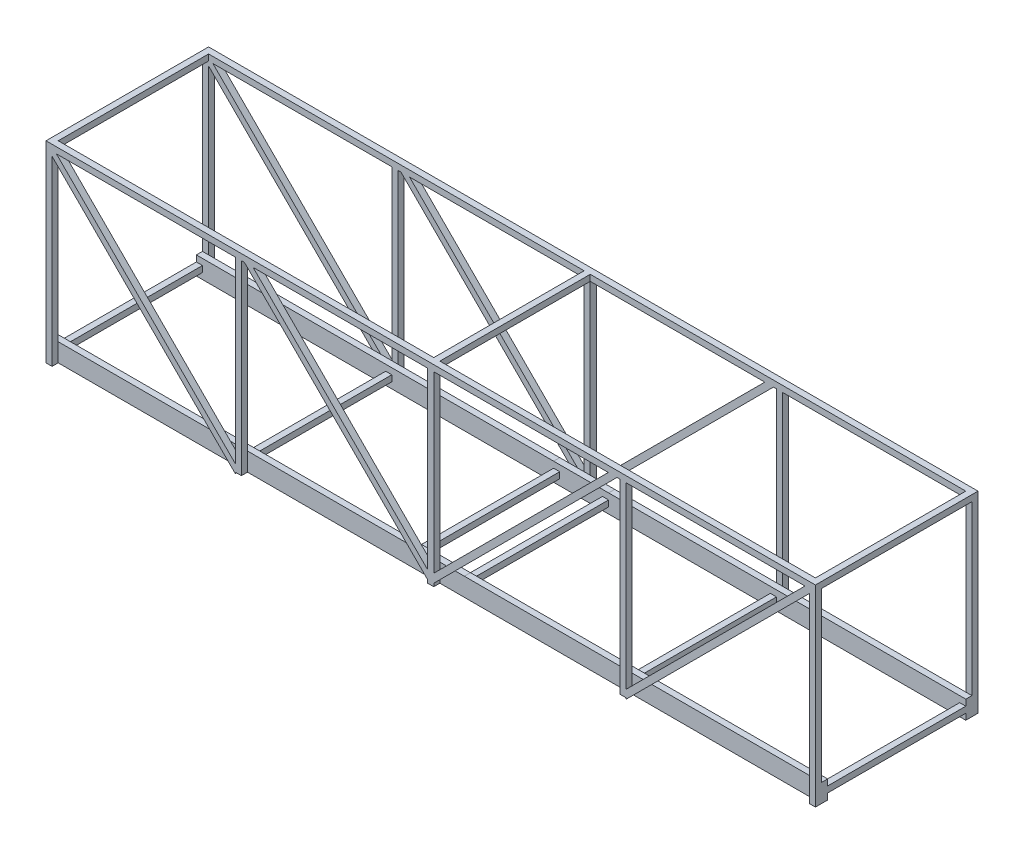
from build123d import *

# Parameters (mm, degrees)
SKETCH12_W                       = 3.175
SKETCH12_H                       = 9.525
STRUCTURAL_MEMBER1_DEPTH         = 400
SKETCH12_ON_SEGMENT_2_W          = 3.175
SKETCH12_ON_SEGMENT_2_H          = 9.525
STRUCTURAL_MEMBER1_2_DEPTH       = 400
SKETCH14_W                       = 3.175
SKETCH14_H                       = 3.175
STRUCTURAL_MEMBER2_DEPTH         = 75
SKETCH15_W                       = 3.175
SKETCH15_H                       = 3.175
STRUCTURAL_MEMBER3_DEPTH         = 75
SKETCH16_W                       = 3.175
SKETCH16_H                       = 3.175
STRUCTURAL_MEMBER4_DEPTH         = 75
SKETCH16_ON_SEGMENT_2_W          = 3.175
SKETCH16_ON_SEGMENT_2_H          = 3.175
STRUCTURAL_MEMBER4_2_DEPTH       = 75
SKETCH16_ON_SEGMENT_3_W          = 3.175
SKETCH16_ON_SEGMENT_3_H          = 3.175
STRUCTURAL_MEMBER4_3_DEPTH       = 75
SKETCH16_ON_SEGMENT_4_W          = 3.175
SKETCH16_ON_SEGMENT_4_H          = 3.175
STRUCTURAL_MEMBER4_4_DEPTH       = 75
SKETCH17_W                       = 3.175
SKETCH17_H                       = 3.175
STRUCTURAL_MEMBER5_DEPTH         = 100
SKETCH19_W                       = 3.175
SKETCH19_H                       = 3.175
STRUCTURAL_MEMBER6_DEPTH         = 100
SKETCH110_W                      = 3.175
SKETCH110_H                      = 3.175
STRUCTURAL_MEMBER7_DEPTH         = 100
SKETCH110_ON_SEGMENT_2_W         = 3.175
SKETCH110_ON_SEGMENT_2_H         = 3.175
STRUCTURAL_MEMBER7_2_DEPTH       = 100
SKETCH110_ON_SEGMENT_3_W         = 3.175
SKETCH110_ON_SEGMENT_3_H         = 3.175
STRUCTURAL_MEMBER7_3_DEPTH       = 100
SKETCH111_W                      = 3.175
SKETCH111_H                      = 3.175
STRUCTURAL_MEMBER8_DEPTH         = 400
SKETCH125_W                      = 3.175
SKETCH125_H                      = 3.175
STRUCTURAL_MEMBER15_DEPTH        = 100
SKETCH126_W                      = 3.175
SKETCH126_H                      = 3.175
STRUCTURAL_MEMBER16_DEPTH        = 100
SKETCH127_W                      = 3.175
SKETCH127_H                      = 3.175
STRUCTURAL_MEMBER17_DEPTH        = 100
SKETCH127_ON_SEGMENT_2_W         = 3.175
SKETCH127_ON_SEGMENT_2_H         = 3.175
STRUCTURAL_MEMBER17_2_DEPTH      = 100
SKETCH127_ON_SEGMENT_3_W         = 3.175
SKETCH127_ON_SEGMENT_3_H         = 3.175
STRUCTURAL_MEMBER17_3_DEPTH      = 100
SKETCH128_W                      = 3.175
SKETCH128_H                      = 3.175
STRUCTURAL_MEMBER18_DEPTH        = 400
SKETCH113_ON_SEGMENT_1_W         = 3.175
SKETCH113_ON_SEGMENT_1_H         = 3.175
STRUCTURAL_MEMBER9_DEPTH         = 142.421356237
SKETCH113_W                      = 3.175
SKETCH113_H                      = 3.175
STRUCTURAL_MEMBER9_2_DEPTH       = 141.421356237
BODY_START                       = 138.246356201
BODY_21_RUN_ON_DEPTH             = 76.130742
SKETCH130_ON_SEGMENT_1_W         = 3.175
SKETCH130_ON_SEGMENT_1_H         = 3.175
STRUCTURAL_MEMBER19_DEPTH        = 146.911484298
STRUCTURAL_MEMBER19_2_DEPTH      = 141.421356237
STRUCTURAL_MEMBER19_2_DEPTH_BACK = 5.490128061
SKETCH130_W                      = 3.175
SKETCH130_H                      = 3.175
SKETCH116_W                      = 3.175
SKETCH116_H                      = 3.175
STRUCTURAL_MEMBER10_DEPTH        = 141.421356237
BODY_25_RUN_ON_DEPTH             = 143.66642
SKETCH117_W                      = 3.175
SKETCH117_H                      = 3.175
STRUCTURAL_MEMBER11_DEPTH        = 141.421356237
SKETCH133_W                      = 3.175
SKETCH133_H                      = 3.175
STRUCTURAL_MEMBER21_DEPTH        = 141.421356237
BODY_27_RUN_ON_DEPTH             = 143.66642
SKETCH134_W                      = 3.175
SKETCH134_H                      = 3.175
STRUCTURAL_MEMBER22_DEPTH        = 141.421356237
SKETCH119_W                      = 3.175
SKETCH119_H                      = 3.175
STRUCTURAL_MEMBER12_DEPTH        = 78.175
SKETCH120_W                      = 3.175
SKETCH120_H                      = 3.175
STRUCTURAL_MEMBER13_DEPTH        = 78.175
SKETCH123_W                      = 3.175
SKETCH123_H                      = 3.175
STRUCTURAL_MEMBER14_DEPTH        = 78.175


with BuildPart() as part:
    # Sketch12 → Structural Member1 (new body)
    with BuildSketch(Plane(origin=(-200, 0, 37.5), x_dir=(0, 0, -1), z_dir=(1, 0, 0))):
        Rectangle(SKETCH12_W, SKETCH12_H)
    extrude(amount=STRUCTURAL_MEMBER1_DEPTH)


with BuildPart() as body_2:
    # Sketch12 on segment 2 (on carried to segment 2) → Structural Member1 2 (new body)
    with BuildSketch(Plane(origin=(-200, 0, -37.5), x_dir=(0, 0, -1), z_dir=(1, 0, 0))):
        Rectangle(SKETCH12_ON_SEGMENT_2_W, SKETCH12_ON_SEGMENT_2_H)
    extrude(amount=STRUCTURAL_MEMBER1_2_DEPTH)


with BuildPart() as body_3:
    # Sketch14 → Structural Member2 (new body)
    with BuildSketch(Plane(origin=(198.4125, 0, 37.5), x_dir=(-1, 0, 0), z_dir=(0, 0, -1))):
        Rectangle(SKETCH14_W, SKETCH14_H)
    extrude(amount=STRUCTURAL_MEMBER2_DEPTH)

    # Trim_Extend1 17: cut part
    add(part.part, mode=Mode.SUBTRACT)

    # Trim_Extend1 20
    split(bisect_by=Plane(origin=(0, 0, -35.9125), x_dir=(0, -1, 0), z_dir=(0, 0, 1)), keep=Keep.TOP)


with BuildPart() as body_4:
    # Sketch15 → Structural Member3 (new body)
    with BuildSketch(Plane(origin=(-198.4125, 0, 37.5), x_dir=(-1, 0, 0), z_dir=(0, 0, -1))):
        Rectangle(SKETCH15_W, SKETCH15_H)
    extrude(amount=STRUCTURAL_MEMBER3_DEPTH)

    # Trim_Extend1 17: cut part
    add(part.part, mode=Mode.SUBTRACT)

    # Trim_Extend1 34: cut body 2
    add(body_2.part, mode=Mode.SUBTRACT)


with BuildPart() as body_5:
    # Sketch16 → Structural Member4 (new body)
    with BuildSketch(Plane(origin=(-100, 0, -37.5), x_dir=(1, 0, 0), z_dir=(0, 0, 1))):
        Rectangle(SKETCH16_W, SKETCH16_H)
    extrude(amount=STRUCTURAL_MEMBER4_DEPTH)

    # Trim_Extend1
    split(bisect_by=Plane.YX.offset(-35.9125), keep=Keep.TOP)

    # Trim_Extend1 20
    split(bisect_by=Plane(origin=(0, 0, -35.9125), x_dir=(0, -1, 0), z_dir=(0, 0, 1)), keep=Keep.TOP)


with BuildPart() as body_6:
    # Sketch16 on segment 2 (on carried to segment 2) → Structural Member4 2 (new body)
    with BuildSketch(Plane(origin=(-12.7, 0, -37.5), x_dir=(1, 0, 0), z_dir=(0, 0, 1))):
        Rectangle(SKETCH16_ON_SEGMENT_2_W, SKETCH16_ON_SEGMENT_2_H)
    extrude(amount=STRUCTURAL_MEMBER4_2_DEPTH)

    # Trim_Extend1 17: cut part
    add(part.part, mode=Mode.SUBTRACT)

    # Trim_Extend1 34: cut body 2
    add(body_2.part, mode=Mode.SUBTRACT)


with BuildPart() as body_7:
    # Sketch16 on segment 3 (on carried to segment 3) → Structural Member4 3 (new body)
    with BuildSketch(Plane(origin=(12.7, 0, -37.5), x_dir=(1, 0, 0), z_dir=(0, 0, 1))):
        Rectangle(SKETCH16_ON_SEGMENT_3_W, SKETCH16_ON_SEGMENT_3_H)
    extrude(amount=STRUCTURAL_MEMBER4_3_DEPTH)

    # Trim_Extend1 17: cut part
    add(part.part, mode=Mode.SUBTRACT)

    # Trim_Extend1 34: cut body 2
    add(body_2.part, mode=Mode.SUBTRACT)


with BuildPart() as body_8:
    # Sketch16 on segment 4 (on carried to segment 4) → Structural Member4 4 (new body)
    with BuildSketch(Plane(origin=(100, 0, -37.5), x_dir=(1, 0, 0), z_dir=(0, 0, 1))):
        Rectangle(SKETCH16_ON_SEGMENT_4_W, SKETCH16_ON_SEGMENT_4_H)
    extrude(amount=STRUCTURAL_MEMBER4_4_DEPTH)

    # Trim_Extend1
    split(bisect_by=Plane.YX.offset(-35.9125), keep=Keep.TOP)

    # Trim_Extend1 20
    split(bisect_by=Plane(origin=(0, 0, -35.9125), x_dir=(0, -1, 0), z_dir=(0, 0, 1)), keep=Keep.TOP)


with BuildPart() as body_9:
    # Sketch17 → Structural Member5 (new body)
    with BuildSketch(Plane(origin=(-198.4125, -4.7625, 40.675), x_dir=(-1, 0, 0), z_dir=(0, 1, 0))):
        Rectangle(SKETCH17_W, SKETCH17_H)
    extrude(amount=STRUCTURAL_MEMBER5_DEPTH)


with BuildPart() as body_10:
    # Sketch19 → Structural Member6 (new body)
    with BuildSketch(Plane(origin=(198.4125, -4.7625, 40.675), x_dir=(-1, 0, 0), z_dir=(0, 1, 0))):
        Rectangle(SKETCH19_W, SKETCH19_H)
    extrude(amount=STRUCTURAL_MEMBER6_DEPTH)


with BuildPart() as body_11:
    # Sketch110 → Structural Member7 (new body)
    with BuildSketch(Plane(origin=(100, 95.2375, 40.675), x_dir=(1, 0, 0), z_dir=(0, -1, 0))):
        Rectangle(SKETCH110_W, SKETCH110_H)
    extrude(amount=STRUCTURAL_MEMBER7_DEPTH)

    # Trim_Extend2 7
    split(bisect_by=Plane(origin=(0, 92.0625, 40.675), x_dir=(1, 0, 0), z_dir=(0, -1, 0)), keep=Keep.TOP)


with BuildPart() as body_12:
    # Sketch110 on segment 2 (on carried to segment 2) → Structural Member7 2 (new body)
    with BuildSketch(Plane(origin=(0, 95.2375, 40.675), x_dir=(1, 0, 0), z_dir=(0, -1, 0))):
        Rectangle(SKETCH110_ON_SEGMENT_2_W, SKETCH110_ON_SEGMENT_2_H)
    extrude(amount=STRUCTURAL_MEMBER7_2_DEPTH)

    # Trim_Extend2 7
    split(bisect_by=Plane(origin=(0, 92.0625, 40.675), x_dir=(1, 0, 0), z_dir=(0, -1, 0)), keep=Keep.TOP)


with BuildPart() as body_13:
    # Sketch110 on segment 3 (on carried to segment 3) → Structural Member7 3 (new body)
    with BuildSketch(Plane(origin=(-100, 95.2375, 40.675), x_dir=(1, 0, 0), z_dir=(0, -1, 0))):
        Rectangle(SKETCH110_ON_SEGMENT_3_W, SKETCH110_ON_SEGMENT_3_H)
    extrude(amount=STRUCTURAL_MEMBER7_3_DEPTH)


with BuildPart() as body_14:
    # Sketch111 → Structural Member8 (new body)
    with BuildSketch(Plane(origin=(-200, 93.65, 40.675), x_dir=(0, 1, 0), z_dir=(1, 0, 0))):
        Rectangle(SKETCH111_W, SKETCH111_H)
    extrude(amount=STRUCTURAL_MEMBER8_DEPTH)


with BuildPart() as body_9_1:
    add(body_9.part)

    # Trim_Extend2 17: cut body 14
    add(body_14.part, mode=Mode.SUBTRACT)


with BuildPart() as body_13_1:
    add(body_13.part)

    # Trim_Extend2 17: cut body 14
    add(body_14.part, mode=Mode.SUBTRACT)


with BuildPart() as body_10_1:
    add(body_10.part)

    # Trim_Extend2 17: cut body 14
    add(body_14.part, mode=Mode.SUBTRACT)


with BuildPart() as body_15:
    # Sketch125 → Structural Member15 (new body)
    with BuildSketch(Plane(origin=(198.4125, -4.7625, -40.675), x_dir=(1, 0, 0), z_dir=(0, 1, 0))):
        Rectangle(SKETCH125_W, SKETCH125_H)
    extrude(amount=STRUCTURAL_MEMBER15_DEPTH)

    # Trim_Extend3 5
    split(bisect_by=Plane(origin=(0, 92.0625, -40.675), x_dir=(1, 0, 0), z_dir=(0, -1, 0)), keep=Keep.TOP)


with BuildPart() as body_16:
    # Sketch126 → Structural Member16 (new body)
    with BuildSketch(Plane(origin=(-198.4125, -4.7625, -40.675), x_dir=(1, 0, 0), z_dir=(0, 1, 0))):
        Rectangle(SKETCH126_W, SKETCH126_H)
    extrude(amount=STRUCTURAL_MEMBER16_DEPTH)


with BuildPart() as body_17:
    # Sketch127 → Structural Member17 (new body)
    with BuildSketch(Plane(origin=(100, -4.7625, -40.675), x_dir=(1, 0, 0), z_dir=(0, 1, 0))):
        Rectangle(SKETCH127_W, SKETCH127_H)
    extrude(amount=STRUCTURAL_MEMBER17_DEPTH)


with BuildPart() as body_18:
    # Sketch127 on segment 2 (on carried to segment 2) → Structural Member17 2 (new body)
    with BuildSketch(Plane(origin=(0, -4.7625, -40.675), x_dir=(1, 0, 0), z_dir=(0, 1, 0))):
        Rectangle(SKETCH127_ON_SEGMENT_2_W, SKETCH127_ON_SEGMENT_2_H)
    extrude(amount=STRUCTURAL_MEMBER17_2_DEPTH)

    # Trim_Extend3 5
    split(bisect_by=Plane(origin=(0, 92.0625, -40.675), x_dir=(1, 0, 0), z_dir=(0, -1, 0)), keep=Keep.TOP)


with BuildPart() as body_19:
    # Sketch127 on segment 3 (on carried to segment 3) → Structural Member17 3 (new body)
    with BuildSketch(Plane(origin=(-100, -4.7625, -40.675), x_dir=(1, 0, 0), z_dir=(0, 1, 0))):
        Rectangle(SKETCH127_ON_SEGMENT_3_W, SKETCH127_ON_SEGMENT_3_H)
    extrude(amount=STRUCTURAL_MEMBER17_3_DEPTH)

    # Trim_Extend3 5
    split(bisect_by=Plane(origin=(0, 92.0625, -40.675), x_dir=(1, 0, 0), z_dir=(0, -1, 0)), keep=Keep.TOP)


with BuildPart() as body_20:
    # Sketch128 → Structural Member18 (new body)
    with BuildSketch(Plane(origin=(-200, 93.65, -40.675), x_dir=(0, -1, 0), z_dir=(1, 0, 0))):
        Rectangle(SKETCH128_W, SKETCH128_H)
    extrude(amount=STRUCTURAL_MEMBER18_DEPTH)


with BuildPart() as body_17_1:
    add(body_17.part)

    # Trim_Extend3 17: cut body 20
    add(body_20.part, mode=Mode.SUBTRACT)


with BuildPart() as body_16_1:
    add(body_16.part)

    # Trim_Extend3 17: cut body 20
    add(body_20.part, mode=Mode.SUBTRACT)


with BuildPart() as body_21:
    # Sketch113 on segment 1 (on carried to segment 1) → Structural Member9 (new body)
    with BuildSketch(Plane(origin=(-98.877467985, 96.360032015, 40.675), x_dir=(0.707106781, 0.707106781, 0), z_dir=(0.707106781, -0.707106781, 0))):
        Rectangle(SKETCH113_ON_SEGMENT_1_W, SKETCH113_ON_SEGMENT_1_H)
    extrude(amount=STRUCTURAL_MEMBER9_DEPTH)

    # Structural Member9 end butt 1
    split(bisect_by=Plane(origin=(-2.24506403, -2.51743597, 39.0875), x_dir=(-0.707106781, -0.707106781, 0), z_dir=(-0.707106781, 0.707106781, 0)), keep=Keep.TOP)

    # Sketch113 on segment 1 (on carried to segment 1) → body 21 run on (add)
    with BuildSketch(Plane(origin=(-98.877467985, 96.360032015, 40.675), x_dir=(0.707106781, 0.707106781, 0), z_dir=(0.707106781, -0.707106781, 0)).offset(BODY_START)):
        Rectangle(SKETCH113_ON_SEGMENT_1_W, SKETCH113_ON_SEGMENT_1_H)
    extrude(amount=BODY_21_RUN_ON_DEPTH)

    # Trim_Extend6 7
    split(bisect_by=Plane(origin=(0, 92.0625, 40.675), x_dir=(1, 0, 0), z_dir=(0, -1, 0)), keep=Keep.TOP)

    # Trim_Extend6 24
    split(bisect_by=Plane(origin=(-1.5875, 43.65, 40.675), x_dir=(0, -1, 0), z_dir=(-1, 0, 0)), keep=Keep.TOP)


with BuildPart() as body_22:
    # Sketch113 → Structural Member9 2 (new body)
    with BuildSketch(Plane(origin=(-1.122532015, -3.639967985, 40.675), x_dir=(-0.707106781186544, 0.7071067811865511, 0), z_dir=(0.7071067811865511, 0.707106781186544, 0))):
        Rectangle(SKETCH113_W, SKETCH113_H)
    extrude(amount=STRUCTURAL_MEMBER9_2_DEPTH)

    # Trim_Extend6 7
    split(bisect_by=Plane(origin=(0, 92.0625, 40.675), x_dir=(1, 0, 0), z_dir=(0, -1, 0)), keep=Keep.TOP)

    # Trim_Extend6 22
    split(bisect_by=Plane(origin=(1.5875, 43.65, 40.675), x_dir=(0, 1, 0), z_dir=(1, 0, 0)), keep=Keep.TOP)


with BuildPart() as body_23:
    # Sketch130 on segment 1 (on carried to segment 1) → Structural Member19 (new body)
    with BuildSketch(Plane(origin=(-98.877467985, 96.360032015, -40.675), x_dir=(-0.707106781, -0.707106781, 0), z_dir=(0.707106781, -0.707106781, 0))):
        Rectangle(SKETCH130_ON_SEGMENT_1_W, SKETCH130_ON_SEGMENT_1_H)
    extrude(amount=STRUCTURAL_MEMBER19_DEPTH)

    # Structural Member19 mitre 1
    split(bisect_by=Plane(origin=(0, -4.7625, -39.0875), x_dir=(0, -1, 0), z_dir=(-1, 0, 0)), keep=Keep.TOP)

    # Trim_Extend17 5
    split(bisect_by=Plane(origin=(0, 92.0625, -40.675), x_dir=(1, 0, 0), z_dir=(0, -1, 0)), keep=Keep.TOP)

    # Trim_Extend17 24
    split(bisect_by=Plane(origin=(-1.5875, 43.65, -40.675), x_dir=(0, -1, 0), z_dir=(-1, 0, 0)), keep=Keep.TOP)


with BuildPart() as body_24:
    # Sketch130 → Structural Member19 2 (new, two sides: drawn at the far end of the back side and taken through both)
    with BuildSketch(Plane(origin=(-1.122532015, -3.639967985, -40.675), x_dir=(0.7071067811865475, -0.7071067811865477, 0), z_dir=(0.7071067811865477, 0.7071067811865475, 0)).offset(-STRUCTURAL_MEMBER19_2_DEPTH_BACK)):
        Rectangle(SKETCH130_W, SKETCH130_H)
    extrude(amount=STRUCTURAL_MEMBER19_2_DEPTH + STRUCTURAL_MEMBER19_2_DEPTH_BACK)

    # Structural Member19 2 mitre 1
    split(bisect_by=Plane(origin=(0, -4.7625, -39.0875), x_dir=(0, 1, 0), z_dir=(1, 0, 0)), keep=Keep.TOP)

    # Trim_Extend17 5
    split(bisect_by=Plane(origin=(0, 92.0625, -40.675), x_dir=(1, 0, 0), z_dir=(0, -1, 0)), keep=Keep.TOP)

    # Trim_Extend17 34: cut body 18
    add(body_18.part, mode=Mode.SUBTRACT)


with BuildPart() as body_25:
    # Sketch116 → Structural Member10 (new body)
    with BuildSketch(Plane(origin=(100, -4.7625, 40.675), x_dir=(-0.7071067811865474, 0.7071067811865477, 0), z_dir=(0.7071067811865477, 0.7071067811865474, 0))):
        Rectangle(SKETCH116_W, SKETCH116_H)
    extrude(amount=STRUCTURAL_MEMBER10_DEPTH)

    # Sketch116 → body 25 run on (add)
    with BuildSketch(Plane(origin=(100, -4.7625, 40.675), x_dir=(-0.7071067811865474, 0.7071067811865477, 0), z_dir=(0.7071067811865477, 0.7071067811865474, 0))):
        Rectangle(SKETCH116_W, SKETCH116_H)
    extrude(amount=-BODY_25_RUN_ON_DEPTH)

    # Trim_Extend8 5
    split(bisect_by=Plane(origin=(101.5875, 43.65, 40.675), x_dir=(0, 1, 0), z_dir=(1, 0, 0)), keep=Keep.TOP)

    # Trim_Extend8 24
    split(bisect_by=Plane(origin=(0, 92.0625, 40.675), x_dir=(1, 0, 0), z_dir=(0, -1, 0)), keep=Keep.TOP)

    # Trim_Extend8 39
    split(bisect_by=Plane(origin=(196.825, 43.65, 40.675), x_dir=(0, -1, 0), z_dir=(-1, 0, 0)), keep=Keep.TOP)


with BuildPart() as body_26:
    # Sketch117 → Structural Member11 (new body)
    with BuildSketch(Plane(origin=(-200, 95.2375, 40.675), x_dir=(0.7071067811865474, 0.7071067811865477, 0), z_dir=(0.7071067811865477, -0.7071067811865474, 0))):
        Rectangle(SKETCH117_W, SKETCH117_H)
    extrude(amount=STRUCTURAL_MEMBER11_DEPTH)

    # Trim_Extend16 7
    split(bisect_by=Plane(origin=(-101.5875, 43.65, 40.675), x_dir=(0, -1, 0), z_dir=(-1, 0, 0)), keep=Keep.TOP)

    # Trim_Extend15 7
    split(bisect_by=Plane(origin=(0, 92.0625, 40.675), x_dir=(1, 0, 0), z_dir=(0, -1, 0)), keep=Keep.TOP)

    # Trim_Extend15 34: cut body 9
    add(body_9_1.part, mode=Mode.SUBTRACT)


with BuildPart() as body_27:
    # Sketch133 → Structural Member21 (new body)
    with BuildSketch(Plane(origin=(-100, -4.7625, -40.675), x_dir=(0.7071067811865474, 0.7071067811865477, 0), z_dir=(-0.7071067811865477, 0.7071067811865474, 0))):
        Rectangle(SKETCH133_W, SKETCH133_H)
    extrude(amount=STRUCTURAL_MEMBER21_DEPTH)

    # Sketch133 → body 27 run on (add)
    with BuildSketch(Plane(origin=(-100, -4.7625, -40.675), x_dir=(0.7071067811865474, 0.7071067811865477, 0), z_dir=(-0.7071067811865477, 0.7071067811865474, 0))):
        Rectangle(SKETCH133_W, SKETCH133_H)
    extrude(amount=-BODY_27_RUN_ON_DEPTH)

    # Trim_Extend13 7
    split(bisect_by=Plane(origin=(-101.5875, 43.65, -40.675), x_dir=(0, -1, 0), z_dir=(-1, 0, 0)), keep=Keep.TOP)

    # Trim_Extend13 22
    split(bisect_by=Plane(origin=(0, 92.0625, -40.675), x_dir=(1, 0, 0), z_dir=(0, -1, 0)), keep=Keep.TOP)

    # Trim_Extend13 39
    split(bisect_by=Plane(origin=(-196.825, 43.65, -40.675), x_dir=(0, 1, 0), z_dir=(1, 0, 0)), keep=Keep.TOP)


with BuildPart() as body_28:
    # Sketch134 → Structural Member22 (new body)
    with BuildSketch(Plane(origin=(100, -4.7625, -40.675), x_dir=(0.7071067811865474, -0.7071067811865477, 0), z_dir=(0.7071067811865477, 0.7071067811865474, 0))):
        Rectangle(SKETCH134_W, SKETCH134_H)
    extrude(amount=STRUCTURAL_MEMBER22_DEPTH)

    # Trim_Extend14 7
    split(bisect_by=Plane(origin=(196.825, 43.65, -40.675), x_dir=(0, -1, 0), z_dir=(-1, 0, 0)), keep=Keep.TOP)

    # Trim_Extend14 34: cut body 20
    add(body_20.part, mode=Mode.SUBTRACT)

    # Trim_Extend14 39
    split(bisect_by=Plane(origin=(101.5875, 43.65, -40.675), x_dir=(0, 1, 0), z_dir=(1, 0, 0)), keep=Keep.TOP)


with BuildPart() as body_29:
    # Sketch119 → Structural Member12 (new body)
    with BuildSketch(Plane(origin=(198.4125, 93.65, 39.0875), x_dir=(-1, 0, 0), z_dir=(0, 0, -1))):
        Rectangle(SKETCH119_W, SKETCH119_H)
    extrude(amount=STRUCTURAL_MEMBER12_DEPTH)


with BuildPart() as body_30:
    # Sketch120 → Structural Member13 (new body)
    with BuildSketch(Plane(origin=(-198.4125, 93.65, 39.0875), x_dir=(-1, 0, 0), z_dir=(0, 0, -1))):
        Rectangle(SKETCH120_W, SKETCH120_H)
    extrude(amount=STRUCTURAL_MEMBER13_DEPTH)


with BuildPart() as body_31:
    # Sketch123 → Structural Member14 (new body)
    with BuildSketch(Plane(origin=(0, 93.65, 39.0875), x_dir=(-1, 0, 0), z_dir=(0, 0, -1))):
        Rectangle(SKETCH123_W, SKETCH123_H)
    extrude(amount=STRUCTURAL_MEMBER14_DEPTH)


with BuildPart() as body_15_1:
    add(body_15.part)

    # Combine1: union body 5, body 14, body 21, body 2, body 10, body 30, body 8, body 19, body 12, body 28, body 31, body 17, body 6, body 26, body 24, body 9, body 22, body 20, body 4, body 3, body 16, part, body 11, body 29, body 18, body 7, body 13, body 25, body 27, body 23
    add(body_5.part)
    add(body_14.part)
    add(body_21.part)
    add(body_2.part)
    add(body_10_1.part)
    add(body_30.part)
    add(body_8.part)
    add(body_19.part)
    add(body_12.part)
    add(body_28.part)
    add(body_31.part)
    add(body_17_1.part)
    add(body_6.part)
    add(body_26.part)
    add(body_24.part)
    add(body_9_1.part)
    add(body_22.part)
    add(body_20.part)
    add(body_4.part)
    add(body_3.part)
    add(body_16_1.part)
    add(part.part)
    add(body_11.part)
    add(body_29.part)
    add(body_18.part)
    add(body_7.part)
    add(body_13_1.part)
    add(body_25.part)
    add(body_27.part)
    add(body_23.part)


solid = body_15_1.part
